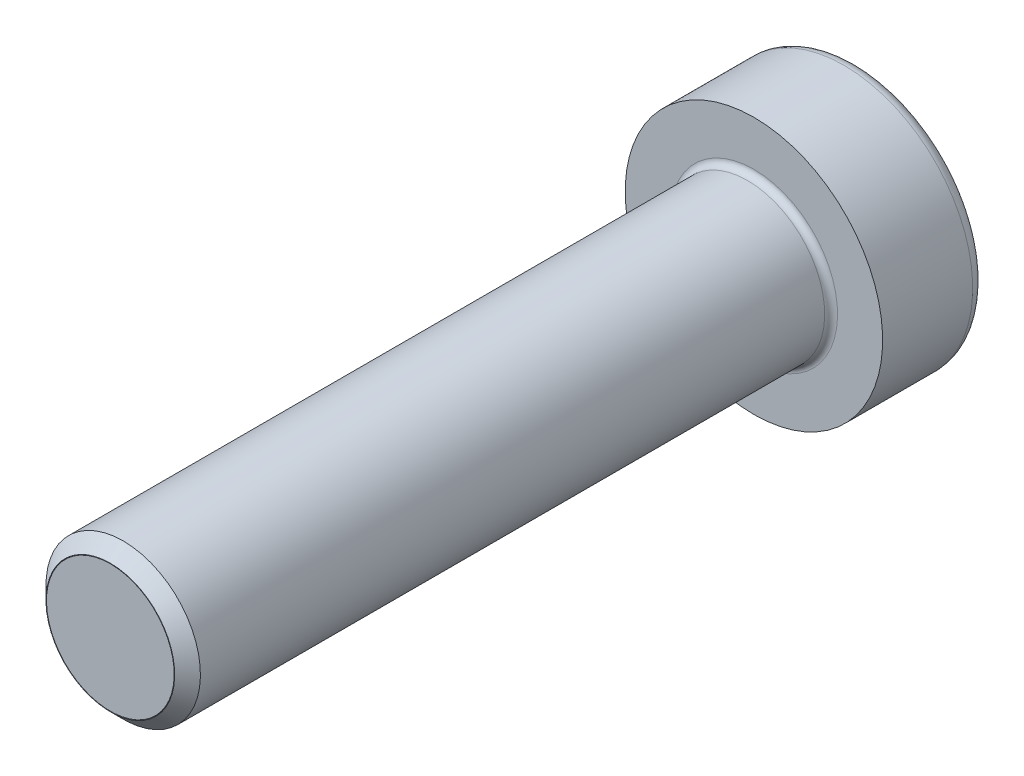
from build123d import *

# Parameters (mm, degrees)
CUT_EXTRUDE1_DEPTH = 2


with BuildPart() as part:
    # Sketch1 → Revolve1 (revolve)
    with BuildSketch(Plane(origin=(0, 0, 0), x_dir=(0, 0, -1), z_dir=(1, 0, 0))):
        with BuildLine():
            Line((-25, 0), (4, 0))
            Line((4, 0), (4, 4.5))
            ThreePointArc((4, 4.5), (3.853553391, 4.853553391), (3.5, 5))
            Line((3.5, 5), (0, 5))
            Line((0, 5), (0, 3.25))
            ThreePointArc((0, 3.25), (-0.073223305, 3.073223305), (-0.25, 3))
            Line((-0.25, 3), (-24.5, 3))
            Line((-24.5, 3), (-25, 2.5))
            Line((-25, 2.5), (-3, 2.5))
            Line((-3, 2.5), (-2.52, 2.98))
            Line((-2.52, 2.98), (-2.5, 2.98))
            Line((-2.5, 2.98), (-3, 2.48))
            Line((-3, 2.48), (-25, 2.48))
            Line((-25, 2.48), (-25, 0))
        make_face()
    revolve(axis=Axis((0, 0, 25), (0, 0, 1)))

    # Sketch2 → Cut-Extrude1 (cut)
    with BuildSketch(Plane(origin=(0, 0, -4), x_dir=(-1, 0, 0), z_dir=(0, 0, -1))):
        Polygon((1.154700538, -2), (2.309401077, 0), (1.154700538, 2), (-1.154700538, 2), (-2.309401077, 0), (-1.154700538, -2), align=None)
    extrude(amount=-CUT_EXTRUDE1_DEPTH, mode=Mode.SUBTRACT)


solid = part.part
